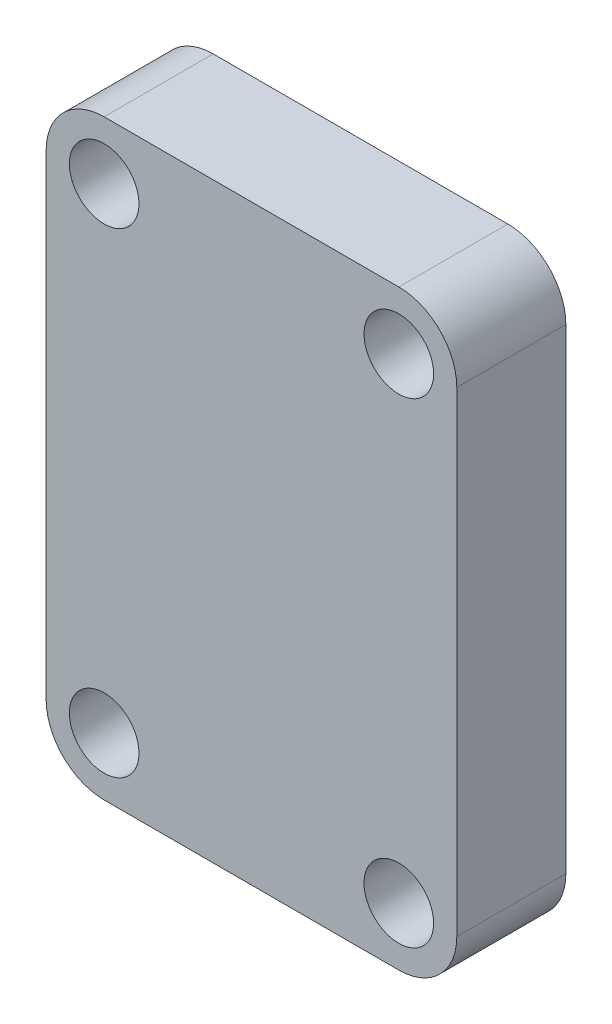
from build123d import *

# Parameters (mm, degrees)
SKETCH1_R           = 1.5
BOSS_EXTRUDE1_DEPTH = 4.7


with BuildPart() as part:
    # Sketch1 → Boss-Extrude1 (new body)
    with BuildSketch(Plane.XY):
        with BuildLine():
            Line((6.35, -12.75), (-6.35, -12.75))
            ThreePointArc((-6.35, -12.75), (-8.117766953, -12.017766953), (-8.85, -10.25))
            Line((-8.85, -10.25), (-8.85, 10.25))
            ThreePointArc((-8.85, 10.25), (-8.117766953, 12.017766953), (-6.35, 12.75))
            Line((-6.35, 12.75), (6.35, 12.75))
            ThreePointArc((6.35, 12.75), (8.117766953, 12.017766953), (8.85, 10.25))
            Line((8.85, 10.25), (8.85, -10.25))
            ThreePointArc((8.85, -10.25), (8.117766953, -12.017766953), (6.35, -12.75))
        make_face()
        with Locations((-6.35, 10.25)):
            Circle(SKETCH1_R, mode=Mode.SUBTRACT)
        with Locations((6.35, 10.25)):
            Circle(SKETCH1_R, mode=Mode.SUBTRACT)
        with Locations((-6.35, -10.25)):
            Circle(SKETCH1_R, mode=Mode.SUBTRACT)
        with Locations((6.35, -10.25)):
            Circle(SKETCH1_R, mode=Mode.SUBTRACT)
    extrude(amount=BOSS_EXTRUDE1_DEPTH)


solid = part.part
